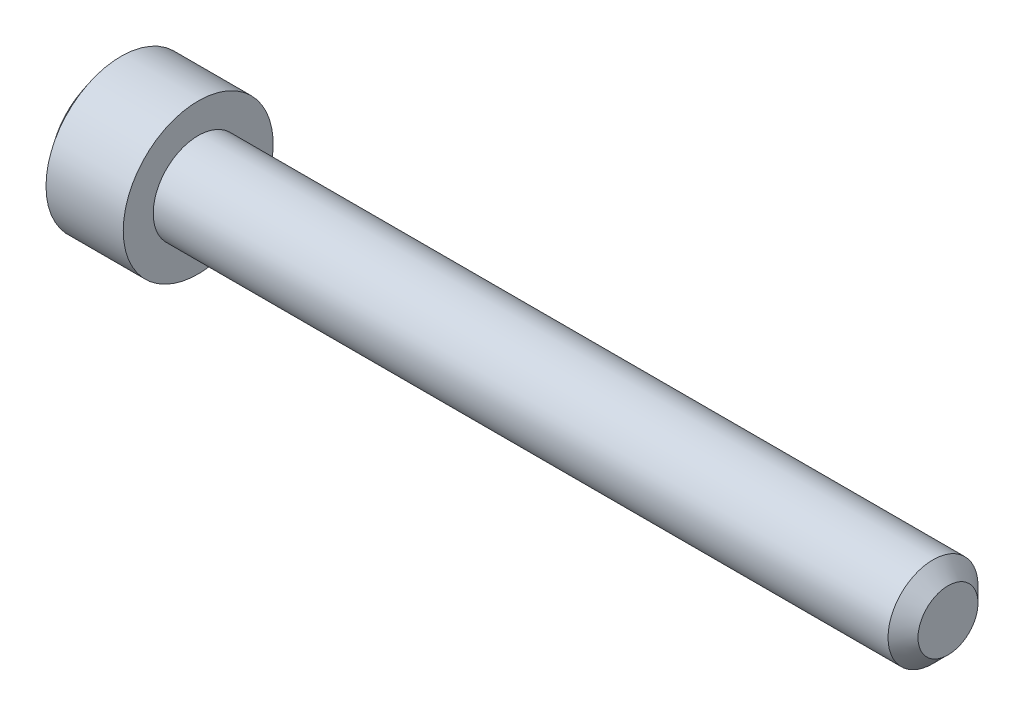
ISO-10303-21;
HEADER;
FILE_DESCRIPTION(('STEP AP214'),'2;1');
FILE_NAME('part.step','',(''),(''),'','','');
FILE_SCHEMA(('AUTOMOTIVE_DESIGN { 1 0 10303 214 1 1 1 1 }'));
ENDSEC;
DATA;
#1=APPLICATION_CONTEXT('core data for automotive mechanical design processes');
#2=APPLICATION_PROTOCOL_DEFINITION('international standard','automotive_design',2000,#1);
#3=PRODUCT_CONTEXT('',#1,'mechanical');
#4=PRODUCT('Part','Part','',(#3));
#5=PRODUCT_RELATED_PRODUCT_CATEGORY('part','',(#4));
#6=PRODUCT_DEFINITION_FORMATION('','',#4);
#7=PRODUCT_DEFINITION_CONTEXT('part definition',#1,'design');
#8=PRODUCT_DEFINITION('design','',#6,#7);
#9=PRODUCT_DEFINITION_SHAPE('','',#8);
#10=(LENGTH_UNIT() NAMED_UNIT(*) SI_UNIT(.MILLI.,.METRE.));
#11=(NAMED_UNIT(*) PLANE_ANGLE_UNIT() SI_UNIT($,.RADIAN.));
#12=(NAMED_UNIT(*) SI_UNIT($,.STERADIAN.) SOLID_ANGLE_UNIT());
#13=UNCERTAINTY_MEASURE_WITH_UNIT(LENGTH_MEASURE(1.E-05),#10,'distance_accuracy_value','');
#14=(GEOMETRIC_REPRESENTATION_CONTEXT(3) GLOBAL_UNCERTAINTY_ASSIGNED_CONTEXT((#13)) GLOBAL_UNIT_ASSIGNED_CONTEXT((#10,
#11,#12)) REPRESENTATION_CONTEXT('',''));
#15=CARTESIAN_POINT('',(0.,0.,0.));
#16=DIRECTION('',(0.,0.,1.));
#17=DIRECTION('',(1.,0.,0.));
#18=AXIS2_PLACEMENT_3D('',#15,#16,#17);
#19=CARTESIAN_POINT('',(0.,0.,0.));
#20=DIRECTION('',(-1.,0.,0.));
#21=DIRECTION('',(0.,0.,1.));
#22=AXIS2_PLACEMENT_3D('',#19,#20,#21);
#23=PLANE('',#22);
#24=CARTESIAN_POINT('',(0.,0.,0.));
#25=DIRECTION('',(-1.,0.,0.));
#26=DIRECTION('',(0.,0.,1.));
#27=AXIS2_PLACEMENT_3D('',#24,#25,#26);
#28=CIRCLE('',#27,3.86862915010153);
#29=CARTESIAN_POINT('',(0.,0.,3.86862915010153));
#30=VERTEX_POINT('',#29);
#31=EDGE_CURVE('E11',#30,#30,#28,.T.);
#32=ORIENTED_EDGE('',*,*,#31,.T.);
#33=EDGE_LOOP('',(#32));
#34=FACE_BOUND('',#33,.T.);
#35=DIRECTION('',(0.,0.909373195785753,-0.415981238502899));
#36=VECTOR('',#35,1.);
#37=CARTESIAN_POINT('',(0.,-2.19361678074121,-1.89600279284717));
#38=LINE('',#37,#36);
#39=CARTESIAN_POINT('',(0.,-2.19361678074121,-1.89600279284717));
#40=VERTEX_POINT('',#39);
#41=CARTESIAN_POINT('',(0.,0.,-2.89944497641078));
#42=VERTEX_POINT('',#41);
#43=EDGE_CURVE('E102',#40,#42,#38,.T.);
#44=ORIENTED_EDGE('',*,*,#43,.T.);
#45=DIRECTION('',(0.,0.862233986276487,0.506510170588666));
#46=VECTOR('',#45,1.);
#47=CARTESIAN_POINT('',(0.,0.,-2.89944497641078));
#48=LINE('',#47,#46);
#49=CARTESIAN_POINT('',(0.,2.53255085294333,-1.41172495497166));
#50=VERTEX_POINT('',#49);
#51=EDGE_CURVE('E47',#42,#50,#48,.T.);
#52=ORIENTED_EDGE('',*,*,#51,.T.);
#53=DIRECTION('',(0.,-0.101933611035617,0.994791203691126));
#54=VECTOR('',#53,1.);
#55=CARTESIAN_POINT('',(0.,2.53255085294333,-1.41172495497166));
#56=LINE('',#55,#54);
#57=CARTESIAN_POINT('',(0.,2.19361678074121,1.89600279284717));
#58=VERTEX_POINT('',#57);
#59=EDGE_CURVE('E92',#50,#58,#56,.T.);
#60=ORIENTED_EDGE('',*,*,#59,.T.);
#61=DIRECTION('',(0.,-0.909373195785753,0.415981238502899));
#62=VECTOR('',#61,1.);
#63=CARTESIAN_POINT('',(0.,2.19361678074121,1.89600279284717));
#64=LINE('',#63,#62);
#65=CARTESIAN_POINT('',(0.,0.,2.89944497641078));
#66=VERTEX_POINT('',#65);
#67=EDGE_CURVE('E97',#58,#66,#64,.T.);
#68=ORIENTED_EDGE('',*,*,#67,.T.);
#69=DIRECTION('',(0.,-0.862233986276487,-0.506510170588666));
#70=VECTOR('',#69,1.);
#71=CARTESIAN_POINT('',(0.,0.,2.89944497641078));
#72=LINE('',#71,#70);
#73=CARTESIAN_POINT('',(0.,-2.53255085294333,1.41172495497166));
#74=VERTEX_POINT('',#73);
#75=EDGE_CURVE('E106',#66,#74,#72,.T.);
#76=ORIENTED_EDGE('',*,*,#75,.T.);
#77=DIRECTION('',(0.,0.101933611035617,-0.994791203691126));
#78=VECTOR('',#77,1.);
#79=CARTESIAN_POINT('',(0.,-2.53255085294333,1.41172495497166));
#80=LINE('',#79,#78);
#81=EDGE_CURVE('E109',#74,#40,#80,.T.);
#82=ORIENTED_EDGE('',*,*,#81,.T.);
#83=EDGE_LOOP('',(#44,#52,#60,#68,#76,#82));
#84=FACE_BOUND('',#83,.T.);
#85=ADVANCED_FACE('F33',(#34,#84),#23,.T.);
#86=CARTESIAN_POINT('',(0.,0.,0.));
#87=DIRECTION('',(1.,0.,0.));
#88=DIRECTION('',(0.,0.,-1.));
#89=AXIS2_PLACEMENT_3D('',#86,#87,#88);
#90=CONICAL_SURFACE('',#89,3.86862915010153,0.927295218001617);
#91=CARTESIAN_POINT('',(0.848528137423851,0.,0.));
#92=DIRECTION('',(-1.,0.,0.));
#93=DIRECTION('',(0.,0.,1.));
#94=AXIS2_PLACEMENT_3D('',#91,#92,#93);
#95=CIRCLE('',#94,5.00000000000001);
#96=CARTESIAN_POINT('',(0.848528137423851,0.,5.00000000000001));
#97=VERTEX_POINT('',#96);
#98=EDGE_CURVE('E40',#97,#97,#95,.T.);
#99=ORIENTED_EDGE('',*,*,#98,.T.);
#100=EDGE_LOOP('',(#99));
#101=FACE_BOUND('',#100,.T.);
#102=ORIENTED_EDGE('',*,*,#31,.F.);
#103=EDGE_LOOP('',(#102));
#104=FACE_BOUND('',#103,.T.);
#105=ADVANCED_FACE('F148',(#101,#104),#90,.T.);
#106=CARTESIAN_POINT('',(-28.5761966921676,0.,0.));
#107=DIRECTION('',(-1.,0.,0.));
#108=DIRECTION('',(0.,0.,1.));
#109=AXIS2_PLACEMENT_3D('',#106,#107,#108);
#110=CYLINDRICAL_SURFACE('',#109,5.00000000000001);
#111=CARTESIAN_POINT('',(6.,0.,0.));
#112=DIRECTION('',(-1.,0.,0.));
#113=DIRECTION('',(0.,0.,1.));
#114=AXIS2_PLACEMENT_3D('',#111,#112,#113);
#115=CIRCLE('',#114,5.00000000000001);
#116=CARTESIAN_POINT('',(6.,0.,5.00000000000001));
#117=VERTEX_POINT('',#116);
#118=EDGE_CURVE('E143',#117,#117,#115,.T.);
#119=ORIENTED_EDGE('',*,*,#118,.T.);
#120=EDGE_LOOP('',(#119));
#121=FACE_BOUND('',#120,.T.);
#122=ORIENTED_EDGE('',*,*,#98,.F.);
#123=EDGE_LOOP('',(#122));
#124=FACE_BOUND('',#123,.T.);
#125=ADVANCED_FACE('F151',(#121,#124),#110,.T.);
#126=CARTESIAN_POINT('',(6.,5.00000000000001,0.));
#127=DIRECTION('',(1.,0.,0.));
#128=DIRECTION('',(0.,0.,-1.));
#129=AXIS2_PLACEMENT_3D('',#126,#127,#128);
#130=PLANE('',#129);
#131=CARTESIAN_POINT('',(6.00000000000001,0.,0.));
#132=DIRECTION('',(-1.,0.,0.));
#133=DIRECTION('',(0.,0.,1.));
#134=AXIS2_PLACEMENT_3D('',#131,#132,#133);
#135=CIRCLE('',#134,2.99999999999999);
#136=CARTESIAN_POINT('',(6.00000000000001,0.,2.99999999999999));
#137=VERTEX_POINT('',#136);
#138=EDGE_CURVE('E140',#137,#137,#135,.T.);
#139=ORIENTED_EDGE('',*,*,#138,.T.);
#140=EDGE_LOOP('',(#139));
#141=FACE_BOUND('',#140,.T.);
#142=ORIENTED_EDGE('',*,*,#118,.F.);
#143=EDGE_LOOP('',(#142));
#144=FACE_BOUND('',#143,.T.);
#145=ADVANCED_FACE('F153',(#141,#144),#130,.T.);
#146=CARTESIAN_POINT('',(-28.5761966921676,0.,0.));
#147=DIRECTION('',(-1.,0.,0.));
#148=DIRECTION('',(0.,0.,1.));
#149=AXIS2_PLACEMENT_3D('',#146,#147,#148);
#150=CYLINDRICAL_SURFACE('',#149,2.99999999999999);
#151=CARTESIAN_POINT('',(55.,0.,0.));
#152=DIRECTION('',(-1.,0.,0.));
#153=DIRECTION('',(0.,0.,1.));
#154=AXIS2_PLACEMENT_3D('',#151,#152,#153);
#155=CIRCLE('',#154,2.99999999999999);
#156=CARTESIAN_POINT('',(55.,0.,2.99999999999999));
#157=VERTEX_POINT('',#156);
#158=EDGE_CURVE('E137',#157,#157,#155,.T.);
#159=ORIENTED_EDGE('',*,*,#158,.T.);
#160=EDGE_LOOP('',(#159));
#161=FACE_BOUND('',#160,.T.);
#162=ORIENTED_EDGE('',*,*,#138,.F.);
#163=EDGE_LOOP('',(#162));
#164=FACE_BOUND('',#163,.T.);
#165=ADVANCED_FACE('F160',(#161,#164),#150,.T.);
#166=CARTESIAN_POINT('',(55.,0.,0.));
#167=DIRECTION('',(-1.,0.,0.));
#168=DIRECTION('',(0.,0.,1.));
#169=AXIS2_PLACEMENT_3D('',#166,#167,#168);
#170=CONICAL_SURFACE('',#169,2.99999999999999,0.785398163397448);
#171=CARTESIAN_POINT('',(56.,0.,0.));
#172=DIRECTION('',(-1.,0.,0.));
#173=DIRECTION('',(0.,0.,1.));
#174=AXIS2_PLACEMENT_3D('',#171,#172,#173);
#175=CIRCLE('',#174,1.99999999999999);
#176=CARTESIAN_POINT('',(56.,0.,1.99999999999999));
#177=VERTEX_POINT('',#176);
#178=EDGE_CURVE('E88',#177,#177,#175,.T.);
#179=ORIENTED_EDGE('',*,*,#178,.T.);
#180=EDGE_LOOP('',(#179));
#181=FACE_BOUND('',#180,.T.);
#182=ORIENTED_EDGE('',*,*,#158,.F.);
#183=EDGE_LOOP('',(#182));
#184=FACE_BOUND('',#183,.T.);
#185=ADVANCED_FACE('F191',(#181,#184),#170,.T.);
#186=CARTESIAN_POINT('',(56.,1.99999999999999,0.));
#187=DIRECTION('',(1.,0.,0.));
#188=DIRECTION('',(0.,0.,-1.));
#189=AXIS2_PLACEMENT_3D('',#186,#187,#188);
#190=PLANE('',#189);
#191=ORIENTED_EDGE('',*,*,#178,.F.);
#192=EDGE_LOOP('',(#191));
#193=FACE_BOUND('',#192,.T.);
#194=ADVANCED_FACE('F201',(#193),#190,.T.);
#195=CARTESIAN_POINT('',(3.,0.,-2.89944497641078));
#196=DIRECTION('',(0.,-0.506510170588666,0.862233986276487));
#197=DIRECTION('',(0.,-0.862233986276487,-0.506510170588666));
#198=AXIS2_PLACEMENT_3D('',#195,#196,#197);
#199=PLANE('',#198);
#200=DIRECTION('',(-1.,0.,0.));
#201=VECTOR('',#200,1.);
#202=CARTESIAN_POINT('',(3.,2.53255085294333,-1.41172495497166));
#203=LINE('',#202,#201);
#204=CARTESIAN_POINT('',(3.,2.53255085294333,-1.41172495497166));
#205=VERTEX_POINT('',#204);
#206=EDGE_CURVE('E81',#205,#50,#203,.T.);
#207=ORIENTED_EDGE('',*,*,#206,.T.);
#208=ORIENTED_EDGE('',*,*,#51,.F.);
#209=DIRECTION('',(-1.,0.,0.));
#210=VECTOR('',#209,1.);
#211=CARTESIAN_POINT('',(3.,0.,-2.89944497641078));
#212=LINE('',#211,#210);
#213=CARTESIAN_POINT('',(3.,0.,-2.89944497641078));
#214=VERTEX_POINT('',#213);
#215=EDGE_CURVE('E51',#214,#42,#212,.T.);
#216=ORIENTED_EDGE('',*,*,#215,.F.);
#217=DIRECTION('',(0.,0.862233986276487,0.506510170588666));
#218=VECTOR('',#217,1.);
#219=CARTESIAN_POINT('',(3.,0.,-2.89944497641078));
#220=LINE('',#219,#218);
#221=EDGE_CURVE('E84',#214,#205,#220,.T.);
#222=ORIENTED_EDGE('',*,*,#221,.T.);
#223=EDGE_LOOP('',(#207,#208,#216,#222));
#224=FACE_BOUND('',#223,.T.);
#225=ADVANCED_FACE('F83',(#224),#199,.T.);
#226=CARTESIAN_POINT('',(3.,2.53255085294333,-1.41172495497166));
#227=DIRECTION('',(0.,-0.994791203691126,-0.101933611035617));
#228=DIRECTION('',(0.,0.101933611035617,-0.994791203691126));
#229=AXIS2_PLACEMENT_3D('',#226,#227,#228);
#230=PLANE('',#229);
#231=DIRECTION('',(-1.,0.,0.));
#232=VECTOR('',#231,1.);
#233=CARTESIAN_POINT('',(3.,2.19361678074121,1.89600279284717));
#234=LINE('',#233,#232);
#235=CARTESIAN_POINT('',(3.,2.19361678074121,1.89600279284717));
#236=VERTEX_POINT('',#235);
#237=EDGE_CURVE('E89',#236,#58,#234,.T.);
#238=ORIENTED_EDGE('',*,*,#237,.T.);
#239=ORIENTED_EDGE('',*,*,#59,.F.);
#240=ORIENTED_EDGE('',*,*,#206,.F.);
#241=DIRECTION('',(0.,-0.101933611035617,0.994791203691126));
#242=VECTOR('',#241,1.);
#243=CARTESIAN_POINT('',(3.,2.53255085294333,-1.41172495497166));
#244=LINE('',#243,#242);
#245=EDGE_CURVE('E113',#205,#236,#244,.T.);
#246=ORIENTED_EDGE('',*,*,#245,.T.);
#247=EDGE_LOOP('',(#238,#239,#240,#246));
#248=FACE_BOUND('',#247,.T.);
#249=ADVANCED_FACE('F93',(#248),#230,.T.);
#250=CARTESIAN_POINT('',(3.,2.19361678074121,1.89600279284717));
#251=DIRECTION('',(0.,-0.415981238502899,-0.909373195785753));
#252=DIRECTION('',(0.,0.909373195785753,-0.415981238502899));
#253=AXIS2_PLACEMENT_3D('',#250,#251,#252);
#254=PLANE('',#253);
#255=DIRECTION('',(-1.,0.,0.));
#256=VECTOR('',#255,1.);
#257=CARTESIAN_POINT('',(3.,0.,2.89944497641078));
#258=LINE('',#257,#256);
#259=CARTESIAN_POINT('',(3.,0.,2.89944497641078));
#260=VERTEX_POINT('',#259);
#261=EDGE_CURVE('E132',#260,#66,#258,.T.);
#262=ORIENTED_EDGE('',*,*,#261,.T.);
#263=ORIENTED_EDGE('',*,*,#67,.F.);
#264=ORIENTED_EDGE('',*,*,#237,.F.);
#265=DIRECTION('',(0.,-0.909373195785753,0.415981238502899));
#266=VECTOR('',#265,1.);
#267=CARTESIAN_POINT('',(3.,2.19361678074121,1.89600279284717));
#268=LINE('',#267,#266);
#269=EDGE_CURVE('E115',#236,#260,#268,.T.);
#270=ORIENTED_EDGE('',*,*,#269,.T.);
#271=EDGE_LOOP('',(#262,#263,#264,#270));
#272=FACE_BOUND('',#271,.T.);
#273=ADVANCED_FACE('F228',(#272),#254,.T.);
#274=CARTESIAN_POINT('',(3.,0.,2.89944497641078));
#275=DIRECTION('',(0.,0.506510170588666,-0.862233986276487));
#276=DIRECTION('',(0.,0.862233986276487,0.506510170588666));
#277=AXIS2_PLACEMENT_3D('',#274,#275,#276);
#278=PLANE('',#277);
#279=DIRECTION('',(-1.,0.,0.));
#280=VECTOR('',#279,1.);
#281=CARTESIAN_POINT('',(3.,-2.53255085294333,1.41172495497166));
#282=LINE('',#281,#280);
#283=CARTESIAN_POINT('',(3.,-2.53255085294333,1.41172495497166));
#284=VERTEX_POINT('',#283);
#285=EDGE_CURVE('E130',#284,#74,#282,.T.);
#286=ORIENTED_EDGE('',*,*,#285,.T.);
#287=ORIENTED_EDGE('',*,*,#75,.F.);
#288=ORIENTED_EDGE('',*,*,#261,.F.);
#289=DIRECTION('',(0.,-0.862233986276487,-0.506510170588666));
#290=VECTOR('',#289,1.);
#291=CARTESIAN_POINT('',(3.,0.,2.89944497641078));
#292=LINE('',#291,#290);
#293=EDGE_CURVE('E118',#260,#284,#292,.T.);
#294=ORIENTED_EDGE('',*,*,#293,.T.);
#295=EDGE_LOOP('',(#286,#287,#288,#294));
#296=FACE_BOUND('',#295,.T.);
#297=ADVANCED_FACE('F237',(#296),#278,.T.);
#298=CARTESIAN_POINT('',(3.,-2.53255085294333,1.41172495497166));
#299=DIRECTION('',(0.,0.994791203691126,0.101933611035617));
#300=DIRECTION('',(0.,-0.101933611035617,0.994791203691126));
#301=AXIS2_PLACEMENT_3D('',#298,#299,#300);
#302=PLANE('',#301);
#303=DIRECTION('',(-1.,0.,0.));
#304=VECTOR('',#303,1.);
#305=CARTESIAN_POINT('',(3.,-2.19361678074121,-1.89600279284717));
#306=LINE('',#305,#304);
#307=CARTESIAN_POINT('',(3.,-2.19361678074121,-1.89600279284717));
#308=VERTEX_POINT('',#307);
#309=EDGE_CURVE('E128',#308,#40,#306,.T.);
#310=ORIENTED_EDGE('',*,*,#309,.T.);
#311=ORIENTED_EDGE('',*,*,#81,.F.);
#312=ORIENTED_EDGE('',*,*,#285,.F.);
#313=DIRECTION('',(0.,0.101933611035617,-0.994791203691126));
#314=VECTOR('',#313,1.);
#315=CARTESIAN_POINT('',(3.,-2.53255085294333,1.41172495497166));
#316=LINE('',#315,#314);
#317=EDGE_CURVE('E121',#284,#308,#316,.T.);
#318=ORIENTED_EDGE('',*,*,#317,.T.);
#319=EDGE_LOOP('',(#310,#311,#312,#318));
#320=FACE_BOUND('',#319,.T.);
#321=ADVANCED_FACE('F247',(#320),#302,.T.);
#322=CARTESIAN_POINT('',(3.,-2.19361678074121,-1.89600279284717));
#323=DIRECTION('',(0.,0.415981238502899,0.909373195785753));
#324=DIRECTION('',(0.,-0.909373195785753,0.415981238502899));
#325=AXIS2_PLACEMENT_3D('',#322,#323,#324);
#326=PLANE('',#325);
#327=DIRECTION('',(0.,0.909373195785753,-0.415981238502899));
#328=VECTOR('',#327,1.);
#329=CARTESIAN_POINT('',(3.,-2.19361678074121,-1.89600279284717));
#330=LINE('',#329,#328);
#331=EDGE_CURVE('E124',#308,#214,#330,.T.);
#332=ORIENTED_EDGE('',*,*,#331,.T.);
#333=ORIENTED_EDGE('',*,*,#215,.T.);
#334=ORIENTED_EDGE('',*,*,#43,.F.);
#335=ORIENTED_EDGE('',*,*,#309,.F.);
#336=EDGE_LOOP('',(#332,#333,#334,#335));
#337=FACE_BOUND('',#336,.T.);
#338=ADVANCED_FACE('F257',(#337),#326,.T.);
#339=CARTESIAN_POINT('',(3.,2.53255085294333,-1.41172495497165));
#340=DIRECTION('',(1.,0.,0.));
#341=DIRECTION('',(0.,0.,-1.));
#342=AXIS2_PLACEMENT_3D('',#339,#340,#341);
#343=PLANE('',#342);
#344=ORIENTED_EDGE('',*,*,#221,.F.);
#345=ORIENTED_EDGE('',*,*,#331,.F.);
#346=ORIENTED_EDGE('',*,*,#317,.F.);
#347=ORIENTED_EDGE('',*,*,#293,.F.);
#348=ORIENTED_EDGE('',*,*,#269,.F.);
#349=ORIENTED_EDGE('',*,*,#245,.F.);
#350=EDGE_LOOP('',(#344,#345,#346,#347,#348,#349));
#351=FACE_BOUND('',#350,.T.);
#352=ADVANCED_FACE('F260',(#351),#343,.F.);
#353=CLOSED_SHELL('',(#85,#105,#125,#145,#165,#185,#194,#225,#249,#273,#297,#321,#338,#352));
#354=MANIFOLD_SOLID_BREP('B2',#353);
#355=ADVANCED_BREP_SHAPE_REPRESENTATION('',(#18,#354),#14);
#356=SHAPE_DEFINITION_REPRESENTATION(#9,#355);
ENDSEC;
END-ISO-10303-21;
